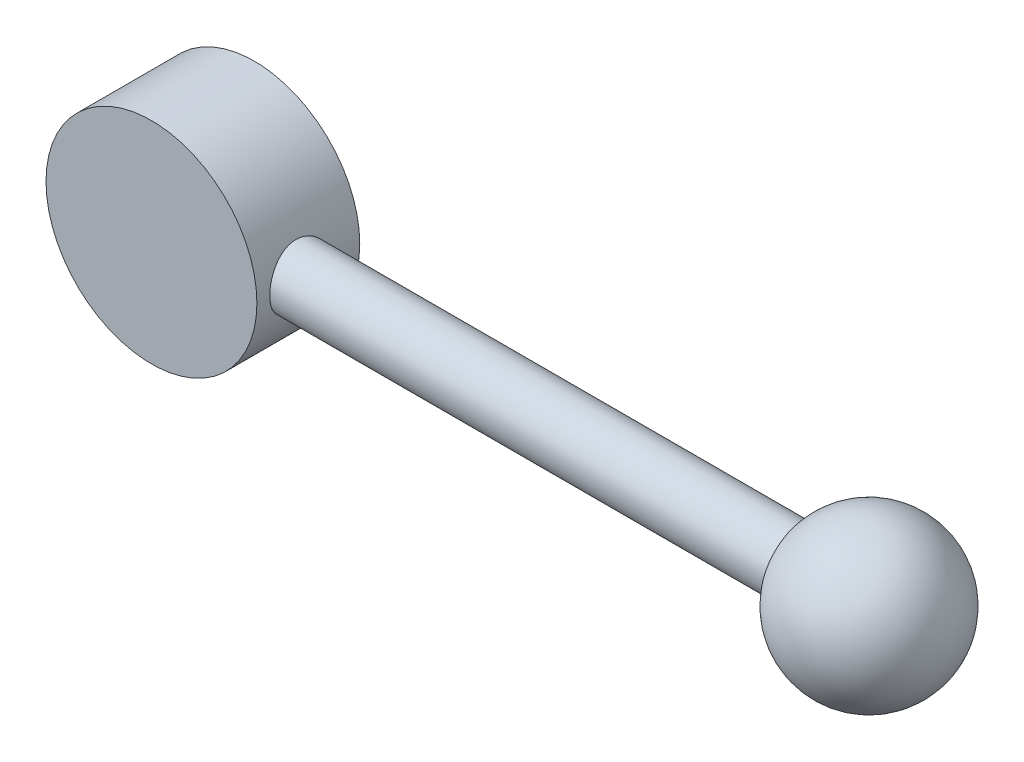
ISO-10303-21;
HEADER;
FILE_DESCRIPTION(('STEP AP214'),'2;1');
FILE_NAME('part.step','',(''),(''),'','','');
FILE_SCHEMA(('AUTOMOTIVE_DESIGN { 1 0 10303 214 1 1 1 1 }'));
ENDSEC;
DATA;
#1=APPLICATION_CONTEXT('core data for automotive mechanical design processes');
#2=APPLICATION_PROTOCOL_DEFINITION('international standard','automotive_design',2000,#1);
#3=PRODUCT_CONTEXT('',#1,'mechanical');
#4=PRODUCT('Part','Part','',(#3));
#5=PRODUCT_RELATED_PRODUCT_CATEGORY('part','',(#4));
#6=PRODUCT_DEFINITION_FORMATION('','',#4);
#7=PRODUCT_DEFINITION_CONTEXT('part definition',#1,'design');
#8=PRODUCT_DEFINITION('design','',#6,#7);
#9=PRODUCT_DEFINITION_SHAPE('','',#8);
#10=(LENGTH_UNIT() NAMED_UNIT(*) SI_UNIT(.MILLI.,.METRE.));
#11=(NAMED_UNIT(*) PLANE_ANGLE_UNIT() SI_UNIT($,.RADIAN.));
#12=(NAMED_UNIT(*) SI_UNIT($,.STERADIAN.) SOLID_ANGLE_UNIT());
#13=UNCERTAINTY_MEASURE_WITH_UNIT(LENGTH_MEASURE(1.E-05),#10,'distance_accuracy_value','');
#14=(GEOMETRIC_REPRESENTATION_CONTEXT(3) GLOBAL_UNCERTAINTY_ASSIGNED_CONTEXT((#13)) GLOBAL_UNIT_ASSIGNED_CONTEXT((#10,
#11,#12)) REPRESENTATION_CONTEXT('',''));
#15=CARTESIAN_POINT('',(0.,0.,0.));
#16=DIRECTION('',(0.,0.,1.));
#17=DIRECTION('',(1.,0.,0.));
#18=AXIS2_PLACEMENT_3D('',#15,#16,#17);
#19=CARTESIAN_POINT('',(0.,0.,0.));
#20=DIRECTION('',(0.,0.,1.));
#21=DIRECTION('',(1.,0.,0.));
#22=AXIS2_PLACEMENT_3D('',#19,#20,#21);
#23=PLANE('',#22);
#24=CARTESIAN_POINT('',(0.,0.,0.));
#25=DIRECTION('',(0.,0.,1.));
#26=DIRECTION('',(1.,0.,0.));
#27=AXIS2_PLACEMENT_3D('',#24,#25,#26);
#28=CIRCLE('',#27,9.5);
#29=CARTESIAN_POINT('',(9.5,0.,0.));
#30=VERTEX_POINT('',#29);
#31=EDGE_CURVE('E8',#30,#30,#28,.T.);
#32=ORIENTED_EDGE('',*,*,#31,.F.);
#33=EDGE_LOOP('',(#32));
#34=FACE_BOUND('',#33,.T.);
#35=CARTESIAN_POINT('',(0.,0.,0.));
#36=DIRECTION('',(0.,0.,-1.));
#37=DIRECTION('',(-1.,0.,0.));
#38=AXIS2_PLACEMENT_3D('',#35,#36,#37);
#39=CIRCLE('',#38,5.);
#40=CARTESIAN_POINT('',(-5.,0.,0.));
#41=VERTEX_POINT('',#40);
#42=EDGE_CURVE('E40',#41,#41,#39,.T.);
#43=ORIENTED_EDGE('',*,*,#42,.F.);
#44=EDGE_LOOP('',(#43));
#45=FACE_BOUND('',#44,.T.);
#46=ADVANCED_FACE('F12',(#34,#45),#23,.F.);
#47=CARTESIAN_POINT('',(0.,0.,40.));
#48=DIRECTION('',(0.,0.,1.));
#49=DIRECTION('',(1.,0.,0.));
#50=AXIS2_PLACEMENT_3D('',#47,#48,#49);
#51=CYLINDRICAL_SURFACE('',#50,9.5);
#52=CARTESIAN_POINT('',(0.,0.,2.));
#53=DIRECTION('',(0.,0.,1.));
#54=DIRECTION('',(1.,0.,0.));
#55=AXIS2_PLACEMENT_3D('',#52,#53,#54);
#56=CIRCLE('',#55,9.5);
#57=CARTESIAN_POINT('',(9.5,0.,2.));
#58=VERTEX_POINT('',#57);
#59=EDGE_CURVE('E34',#58,#58,#56,.T.);
#60=ORIENTED_EDGE('',*,*,#59,.F.);
#61=EDGE_LOOP('',(#60));
#62=FACE_BOUND('',#61,.T.);
#63=ORIENTED_EDGE('',*,*,#31,.T.);
#64=EDGE_LOOP('',(#63));
#65=FACE_BOUND('',#64,.T.);
#66=ADVANCED_FACE('F14',(#62,#65),#51,.T.);
#67=CARTESIAN_POINT('',(20.5,0.,22.));
#68=DIRECTION('',(0.,0.,-1.));
#69=DIRECTION('',(-1.,0.,0.));
#70=AXIS2_PLACEMENT_3D('',#67,#68,#69);
#71=PLANE('',#70);
#72=CARTESIAN_POINT('',(0.,0.,22.));
#73=DIRECTION('',(0.,0.,1.));
#74=DIRECTION('',(1.,0.,0.));
#75=AXIS2_PLACEMENT_3D('',#72,#73,#74);
#76=CIRCLE('',#75,20.5);
#77=CARTESIAN_POINT('',(20.5,0.,22.));
#78=VERTEX_POINT('',#77);
#79=EDGE_CURVE('E25',#78,#78,#76,.T.);
#80=ORIENTED_EDGE('',*,*,#79,.T.);
#81=EDGE_LOOP('',(#80));
#82=FACE_BOUND('',#81,.T.);
#83=ADVANCED_FACE('F70',(#82),#71,.F.);
#84=CARTESIAN_POINT('',(0.,0.,40.));
#85=DIRECTION('',(0.,0.,1.));
#86=DIRECTION('',(1.,0.,0.));
#87=AXIS2_PLACEMENT_3D('',#84,#85,#86);
#88=CYLINDRICAL_SURFACE('',#87,20.5);
#89=CARTESIAN_POINT('',(20.5,0.,7.5));
#90=CARTESIAN_POINT('',(20.4999997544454,-0.164768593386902,7.50000038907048));
#91=CARTESIAN_POINT('',(20.4980087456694,-0.329544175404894,7.50679278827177));
#92=CARTESIAN_POINT('',(20.4900990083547,-0.65788822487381,7.5339021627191));
#93=CARTESIAN_POINT('',(20.4841800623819,-0.821456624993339,7.55421988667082));
#94=CARTESIAN_POINT('',(20.4685766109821,-1.1462122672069,7.60820100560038));
#95=CARTESIAN_POINT('',(20.4588916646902,-1.30739922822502,7.64186596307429));
#96=CARTESIAN_POINT('',(20.4360164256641,-1.62628314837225,7.72226244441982));
#97=CARTESIAN_POINT('',(20.4228249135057,-1.7839788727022,7.76899851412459));
#98=CARTESIAN_POINT('',(20.3933182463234,-2.09448185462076,7.87505403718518));
#99=CARTESIAN_POINT('',(20.3770082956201,-2.24729676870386,7.93435254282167));
#100=CARTESIAN_POINT('',(20.3416823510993,-2.54730770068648,8.06511256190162));
#101=CARTESIAN_POINT('',(20.3226662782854,-2.69450355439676,8.13657443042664));
#102=CARTESIAN_POINT('',(20.2824208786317,-2.98237032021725,8.2911456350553));
#103=CARTESIAN_POINT('',(20.2611910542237,-3.123039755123,8.37425759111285));
#104=CARTESIAN_POINT('',(20.2170775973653,-3.39691169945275,8.55150630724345));
#105=CARTESIAN_POINT('',(20.1941944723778,-3.53011647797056,8.6456396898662));
#106=CARTESIAN_POINT('',(20.146767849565,-3.79154794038,8.84682399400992));
#107=CARTESIAN_POINT('',(20.1221971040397,-3.91956600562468,8.95413966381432));
#108=CARTESIAN_POINT('',(20.0725990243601,-4.1661228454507,9.17897611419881));
#109=CARTESIAN_POINT('',(20.0475718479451,-4.2846648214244,9.29649342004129));
#110=CARTESIAN_POINT('',(19.9977175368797,-4.5116297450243,9.54108035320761));
#111=CARTESIAN_POINT('',(19.9728905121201,-4.62004743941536,9.66815487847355));
#112=CARTESIAN_POINT('',(19.9241410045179,-4.82595045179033,9.93095842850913));
#113=CARTESIAN_POINT('',(19.9002181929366,-4.92343976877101,10.0666842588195));
#114=CARTESIAN_POINT('',(19.8534354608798,-5.10885934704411,10.3490171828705));
#115=CARTESIAN_POINT('',(19.8306098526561,-5.19653638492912,10.4957964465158));
#116=CARTESIAN_POINT('',(19.7872868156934,-5.35913808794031,10.7965125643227));
#117=CARTESIAN_POINT('',(19.766788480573,-5.43406772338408,10.9504465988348));
#118=CARTESIAN_POINT('',(19.7287391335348,-5.57062666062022,11.2645036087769));
#119=CARTESIAN_POINT('',(19.7111887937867,-5.63225293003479,11.4246279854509));
#120=CARTESIAN_POINT('',(19.6796082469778,-5.74162541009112,11.7498143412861));
#121=CARTESIAN_POINT('',(19.6655765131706,-5.78937764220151,11.9148741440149));
#122=CARTESIAN_POINT('',(19.6418018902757,-5.86952471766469,12.2443484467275));
#123=CARTESIAN_POINT('',(19.6319555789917,-5.90229162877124,12.4086649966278));
#124=CARTESIAN_POINT('',(19.6163432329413,-5.95397424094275,12.7395899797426));
#125=CARTESIAN_POINT('',(19.6105755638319,-5.97289549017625,12.9061974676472));
#126=CARTESIAN_POINT('',(19.603301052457,-5.99672775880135,13.2405034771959));
#127=CARTESIAN_POINT('',(19.6017941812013,-6.00163887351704,13.4082019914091));
#128=CARTESIAN_POINT('',(19.6030905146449,-5.99740342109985,13.7434027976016));
#129=CARTESIAN_POINT('',(19.6058936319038,-5.98825713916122,13.9109050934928));
#130=CARTESIAN_POINT('',(19.6155486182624,-5.95655212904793,14.238688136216));
#131=CARTESIAN_POINT('',(19.6222578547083,-5.9344657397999,14.3990190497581));
#132=CARTESIAN_POINT('',(19.6394095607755,-5.87745500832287,14.7172343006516));
#133=CARTESIAN_POINT('',(19.649853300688,-5.84252629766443,14.8751177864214));
#134=CARTESIAN_POINT('',(19.6741615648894,-5.7601395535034,15.187257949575));
#135=CARTESIAN_POINT('',(19.688025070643,-5.71268525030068,15.3415156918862));
#136=CARTESIAN_POINT('',(19.7187796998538,-5.60560692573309,15.6454959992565));
#137=CARTESIAN_POINT('',(19.7356719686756,-5.5459782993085,15.7952168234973));
#138=CARTESIAN_POINT('',(19.7722410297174,-5.41416819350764,16.0910079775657));
#139=CARTESIAN_POINT('',(19.7919506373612,-5.34183608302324,16.2370072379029));
#140=CARTESIAN_POINT('',(19.8334359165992,-5.18568691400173,16.5224423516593));
#141=CARTESIAN_POINT('',(19.8552123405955,-5.10186566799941,16.6618757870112));
#142=CARTESIAN_POINT('',(19.9227548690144,-4.8340177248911,17.0689782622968));
#143=CARTESIAN_POINT('',(19.9707648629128,-4.63350124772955,17.3256854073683));
#144=CARTESIAN_POINT('',(20.0696162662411,-4.18511260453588,17.8126329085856));
#145=CARTESIAN_POINT('',(20.1204944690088,-3.93567819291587,18.0414205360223));
#146=CARTESIAN_POINT('',(20.2176813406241,-3.40132203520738,18.4542852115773));
#147=CARTESIAN_POINT('',(20.2639897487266,-3.11639826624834,18.63835970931));
#148=CARTESIAN_POINT('',(20.3472018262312,-2.51664006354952,18.9573414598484));
#149=CARTESIAN_POINT('',(20.3840462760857,-2.2016334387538,19.0919412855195));
#150=CARTESIAN_POINT('',(20.4437541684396,-1.55212614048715,19.3058343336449));
#151=CARTESIAN_POINT('',(20.4666213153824,-1.21763065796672,19.3851422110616));
#152=CARTESIAN_POINT('',(20.4952175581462,-0.550953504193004,19.4838192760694));
#153=CARTESIAN_POINT('',(20.5015074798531,-0.219085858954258,19.5051506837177));
#154=CARTESIAN_POINT('',(20.4978783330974,0.44350281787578,19.4927506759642));
#155=CARTESIAN_POINT('',(20.4879613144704,0.774223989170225,19.4590262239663));
#156=CARTESIAN_POINT('',(20.4533992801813,1.41781519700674,19.3390673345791));
#157=CARTESIAN_POINT('',(20.4290727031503,1.73091547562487,19.253967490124));
#158=CARTESIAN_POINT('',(20.3684901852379,2.33834273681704,19.0350155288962));
#159=CARTESIAN_POINT('',(20.3322328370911,2.63266749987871,18.901157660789));
#160=CARTESIAN_POINT('',(20.2505580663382,3.201467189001,18.585163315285));
#161=CARTESIAN_POINT('',(20.2049537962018,3.47535043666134,18.4020133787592));
#162=CARTESIAN_POINT('',(20.1098009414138,3.98926947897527,17.9937010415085));
#163=CARTESIAN_POINT('',(20.0602514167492,4.22929716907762,17.7685286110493));
#164=CARTESIAN_POINT('',(19.9860369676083,4.56311282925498,17.3996018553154));
#165=CARTESIAN_POINT('',(19.9608943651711,4.67160496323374,17.2689475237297));
#166=CARTESIAN_POINT('',(19.9116554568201,4.87720494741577,16.9988051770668));
#167=CARTESIAN_POINT('',(19.8875587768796,4.97431688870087,16.8593203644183));
#168=CARTESIAN_POINT('',(19.8411019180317,5.15650338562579,16.5723575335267));
#169=CARTESIAN_POINT('',(19.8187424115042,5.24157329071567,16.4248764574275));
#170=CARTESIAN_POINT('',(19.7764458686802,5.39896546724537,16.1230001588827));
#171=CARTESIAN_POINT('',(19.7565078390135,5.47129297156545,15.9686078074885));
#172=CARTESIAN_POINT('',(19.7197444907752,5.60234699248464,15.6546484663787));
#173=CARTESIAN_POINT('',(19.7029051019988,5.6611353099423,15.49510893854));
#174=CARTESIAN_POINT('',(19.6727610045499,5.76501533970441,15.1713718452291));
#175=CARTESIAN_POINT('',(19.6594548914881,5.81011249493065,15.0071761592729));
#176=CARTESIAN_POINT('',(19.6367999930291,5.88622676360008,14.675294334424));
#177=CARTESIAN_POINT('',(19.6274509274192,5.91724487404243,14.5076084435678));
#178=CARTESIAN_POINT('',(19.6130187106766,5.96490739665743,14.1700260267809));
#179=CARTESIAN_POINT('',(19.6079354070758,5.98155232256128,14.0001295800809));
#180=CARTESIAN_POINT('',(19.6023186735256,5.9999323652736,13.6662567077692));
#181=CARTESIAN_POINT('',(19.6016119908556,6.00223524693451,13.5023141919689));
#182=CARTESIAN_POINT('',(19.6043094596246,5.99341910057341,13.1747666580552));
#183=CARTESIAN_POINT('',(19.6077150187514,5.98229547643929,13.0111617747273));
#184=CARTESIAN_POINT('',(19.6185313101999,5.94672790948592,12.6856110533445));
#185=CARTESIAN_POINT('',(19.6259403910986,5.92228945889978,12.5236645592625));
#186=CARTESIAN_POINT('',(19.6445384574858,5.86030325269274,12.2024601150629));
#187=CARTESIAN_POINT('',(19.6557288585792,5.82275058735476,12.0432031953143));
#188=CARTESIAN_POINT('',(19.6814005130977,5.73537439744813,11.7303823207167));
#189=CARTESIAN_POINT('',(19.6958418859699,5.68569901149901,11.5767736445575));
#190=CARTESIAN_POINT('',(19.7276768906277,5.57423736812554,11.2742707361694));
#191=CARTESIAN_POINT('',(19.7450715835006,5.51244675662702,11.125378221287));
#192=CARTESIAN_POINT('',(19.782319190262,5.37724463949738,10.8333301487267));
#193=CARTESIAN_POINT('',(19.802171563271,5.30383568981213,10.6901733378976));
#194=CARTESIAN_POINT('',(19.8438063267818,5.14587421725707,10.4103722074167));
#195=CARTESIAN_POINT('',(19.8655894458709,5.061317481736,10.2737303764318));
#196=CARTESIAN_POINT('',(19.9112797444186,4.87853600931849,10.0032239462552));
#197=CARTESIAN_POINT('',(19.9352342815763,4.77994030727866,9.86961789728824));
#198=CARTESIAN_POINT('',(19.9839347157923,4.57206196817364,9.61107007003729));
#199=CARTESIAN_POINT('',(20.0086809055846,4.46277534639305,9.48613155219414));
#200=CARTESIAN_POINT('',(20.0582834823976,4.23425660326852,9.24575891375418));
#201=CARTESIAN_POINT('',(20.0831398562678,4.11502564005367,9.13032368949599));
#202=CARTESIAN_POINT('',(20.1323098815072,3.86730499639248,8.90963180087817));
#203=CARTESIAN_POINT('',(20.1566233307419,3.7388119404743,8.80437888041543));
#204=CARTESIAN_POINT('',(20.2046974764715,3.46977987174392,8.6020699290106));
#205=CARTESIAN_POINT('',(20.2284250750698,3.32900807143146,8.50531528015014));
#206=CARTESIAN_POINT('',(20.2739466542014,3.03949915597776,8.32403500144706));
#207=CARTESIAN_POINT('',(20.2957406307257,2.8907620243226,8.23950939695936));
#208=CARTESIAN_POINT('',(20.3367679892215,2.58639447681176,8.0833769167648));
#209=CARTESIAN_POINT('',(20.356002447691,2.43076699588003,8.01176460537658));
#210=CARTESIAN_POINT('',(20.3913677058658,2.11366097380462,7.88201306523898));
#211=CARTESIAN_POINT('',(20.4074988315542,1.95218304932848,7.82387242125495));
#212=CARTESIAN_POINT('',(20.4344672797,1.64423058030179,7.72771145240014));
#213=CARTESIAN_POINT('',(20.4457076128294,1.49828162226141,7.68811373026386));
#214=CARTESIAN_POINT('',(20.4651675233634,1.2036242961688,7.62002138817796));
#215=CARTESIAN_POINT('',(20.4733873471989,1.0549161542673,7.59152586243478));
#216=CARTESIAN_POINT('',(20.4866168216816,0.755624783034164,7.54584620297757));
#217=CARTESIAN_POINT('',(20.491626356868,0.605041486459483,7.52866247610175));
#218=CARTESIAN_POINT('',(20.49831762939,0.302973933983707,7.50574067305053));
#219=CARTESIAN_POINT('',(20.5000002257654,0.151489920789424,7.49999964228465));
#220=CARTESIAN_POINT('',(20.5,0.,7.5));
#221=B_SPLINE_CURVE_WITH_KNOTS('',3,(#89,#90,#91,#92,#93,#94,#95,#96,#97,#98,#99,#100,#101,#102,
#103,#104,#105,#106,#107,#108,#109,#110,#111,#112,#113,#114,#115,#116,#117,#118,#119,#120,#121,
#122,#123,#124,#125,#126,#127,#128,#129,#130,#131,#132,#133,#134,#135,#136,#137,#138,#139,#140,
#141,#142,#143,#144,#145,#146,#147,#148,#149,#150,#151,#152,#153,#154,#155,#156,#157,#158,#159,
#160,#161,#162,#163,#164,#165,#166,#167,#168,#169,#170,#171,#172,#173,#174,#175,#176,#177,#178,
#179,#180,#181,#182,#183,#184,#185,#186,#187,#188,#189,#190,#191,#192,#193,#194,#195,#196,#197,
#198,#199,#200,#201,#202,#203,#204,#205,#206,#207,#208,#209,#210,#211,#212,#213,#214,#215,#216,
#217,#218,#219,#220),.UNSPECIFIED.,.T.,.F.,(4,2,2,2,2,2,2,2,2,2,2,2,2,2,2,2,2,2,2,2,2,2,2,2,2,2,
2,2,2,2,2,2,2,2,2,2,2,2,2,2,2,2,2,2,2,2,2,2,2,2,2,2,2,2,2,2,2,2,2,2,2,2,2,2,2,4),(0.,
0.494166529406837,0.988360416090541,1.48261217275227,1.97703603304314,2.47064184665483,
2.96426207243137,3.45799348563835,3.95157399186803,4.45753270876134,4.96331976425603,
5.46936781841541,5.97523008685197,6.49206535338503,7.00869863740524,7.52544955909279,
8.04197586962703,8.54486934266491,9.04756118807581,9.55024961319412,10.0529278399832,
10.5383093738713,11.0238561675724,11.5092585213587,11.9948448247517,12.4866344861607,
12.9786038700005,13.9617709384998,14.9839152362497,16.006117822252,17.0345689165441,
18.062747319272,19.0556662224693,20.0484595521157,21.0200911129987,21.9918373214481,
22.9853318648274,23.97906383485,24.4935931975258,25.0079370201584,25.5224789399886,
26.0368090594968,26.5487427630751,27.0604726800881,27.5721663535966,28.0838417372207,
28.5751252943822,29.066577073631,29.5578262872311,30.0492596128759,30.5349645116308,
31.0208442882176,31.5066173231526,31.9925744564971,32.4953010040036,32.9982156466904,
33.5010718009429,34.0041121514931,34.5208552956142,35.0375995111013,35.5541256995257,
36.0705976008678,36.525077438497,36.9795201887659,37.4339792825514,37.8883210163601),.UNSPECIFIED.);
#222=CARTESIAN_POINT('',(20.5,0.,7.5));
#223=VERTEX_POINT('',#222);
#224=EDGE_CURVE('E16',#223,#223,#221,.T.);
#225=ORIENTED_EDGE('',*,*,#224,.T.);
#226=EDGE_LOOP('',(#225));
#227=FACE_BOUND('',#226,.T.);
#228=ORIENTED_EDGE('',*,*,#79,.F.);
#229=EDGE_LOOP('',(#228));
#230=FACE_BOUND('',#229,.T.);
#231=CARTESIAN_POINT('',(0.,0.,2.));
#232=DIRECTION('',(0.,0.,1.));
#233=DIRECTION('',(1.,0.,0.));
#234=AXIS2_PLACEMENT_3D('',#231,#232,#233);
#235=CIRCLE('',#234,20.5);
#236=CARTESIAN_POINT('',(20.5,0.,2.));
#237=VERTEX_POINT('',#236);
#238=EDGE_CURVE('E29',#237,#237,#235,.T.);
#239=ORIENTED_EDGE('',*,*,#238,.T.);
#240=EDGE_LOOP('',(#239));
#241=FACE_BOUND('',#240,.T.);
#242=ADVANCED_FACE('F75',(#227,#230,#241),#88,.T.);
#243=CARTESIAN_POINT('',(9.5,0.,2.));
#244=DIRECTION('',(0.,0.,1.));
#245=DIRECTION('',(1.,0.,0.));
#246=AXIS2_PLACEMENT_3D('',#243,#244,#245);
#247=PLANE('',#246);
#248=ORIENTED_EDGE('',*,*,#238,.F.);
#249=EDGE_LOOP('',(#248));
#250=FACE_BOUND('',#249,.T.);
#251=ORIENTED_EDGE('',*,*,#59,.T.);
#252=EDGE_LOOP('',(#251));
#253=FACE_BOUND('',#252,.T.);
#254=ADVANCED_FACE('F80',(#250,#253),#247,.F.);
#255=CARTESIAN_POINT('',(-30.,0.,13.5));
#256=DIRECTION('',(-1.,0.,0.));
#257=DIRECTION('',(0.,0.,1.));
#258=AXIS2_PLACEMENT_3D('',#255,#256,#257);
#259=CYLINDRICAL_SURFACE('',#258,6.);
#260=CARTESIAN_POINT('',(117.252272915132,0.,13.5));
#261=DIRECTION('',(-1.,0.,0.));
#262=DIRECTION('',(0.,0.,1.));
#263=AXIS2_PLACEMENT_3D('',#260,#261,#262);
#264=CIRCLE('',#263,6.);
#265=CARTESIAN_POINT('',(117.252272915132,0.,19.5));
#266=VERTEX_POINT('',#265);
#267=EDGE_CURVE('E37',#266,#266,#264,.T.);
#268=ORIENTED_EDGE('',*,*,#267,.T.);
#269=EDGE_LOOP('',(#268));
#270=FACE_BOUND('',#269,.T.);
#271=ORIENTED_EDGE('',*,*,#224,.F.);
#272=EDGE_LOOP('',(#271));
#273=FACE_BOUND('',#272,.T.);
#274=ADVANCED_FACE('F61',(#270,#273),#259,.T.);
#275=CARTESIAN_POINT('',(131.,0.,13.5));
#276=DIRECTION('',(0.,0.,1.));
#277=DIRECTION('',(1.,0.,0.));
#278=AXIS2_PLACEMENT_3D('',#275,#276,#277);
#279=SPHERICAL_SURFACE('',#278,15.);
#280=CARTESIAN_POINT('',(131.,0.,13.5));
#281=DIRECTION('',(-1.,0.,0.));
#282=DIRECTION('',(0.,0.,1.));
#283=AXIS2_PLACEMENT_3D('',#280,#281,#282);
#284=SPHERICAL_SURFACE('',#283,15.);
#285=ORIENTED_EDGE('',*,*,#267,.F.);
#286=EDGE_LOOP('',(#285));
#287=FACE_BOUND('',#286,.T.);
#288=ADVANCED_FACE('F51',(#287),#284,.T.);
#289=CARTESIAN_POINT('',(0.,0.,0.));
#290=DIRECTION('',(0.,0.,-1.));
#291=DIRECTION('',(-1.,0.,0.));
#292=AXIS2_PLACEMENT_3D('',#289,#290,#291);
#293=CYLINDRICAL_SURFACE('',#292,5.);
#294=ORIENTED_EDGE('',*,*,#42,.T.);
#295=EDGE_LOOP('',(#294));
#296=FACE_BOUND('',#295,.T.);
#297=CARTESIAN_POINT('',(0.,0.,21.));
#298=DIRECTION('',(0.,0.,-1.));
#299=DIRECTION('',(-1.,0.,0.));
#300=AXIS2_PLACEMENT_3D('',#297,#298,#299);
#301=CIRCLE('',#300,5.);
#302=CARTESIAN_POINT('',(-5.,0.,21.));
#303=VERTEX_POINT('',#302);
#304=EDGE_CURVE('E43',#303,#303,#301,.T.);
#305=ORIENTED_EDGE('',*,*,#304,.F.);
#306=EDGE_LOOP('',(#305));
#307=FACE_BOUND('',#306,.T.);
#308=ADVANCED_FACE('F49',(#296,#307),#293,.F.);
#309=CARTESIAN_POINT('',(0.,0.,21.));
#310=DIRECTION('',(0.,0.,-1.));
#311=DIRECTION('',(-1.,0.,0.));
#312=AXIS2_PLACEMENT_3D('',#309,#310,#311);
#313=PLANE('',#312);
#314=ORIENTED_EDGE('',*,*,#304,.T.);
#315=EDGE_LOOP('',(#314));
#316=FACE_BOUND('',#315,.T.);
#317=ADVANCED_FACE('F47',(#316),#313,.T.);
#318=CLOSED_SHELL('',(#46,#66,#83,#242,#254,#274,#288,#308,#317));
#319=MANIFOLD_SOLID_BREP('B1',#318);
#320=ADVANCED_BREP_SHAPE_REPRESENTATION('',(#18,#319),#14);
#321=SHAPE_DEFINITION_REPRESENTATION(#9,#320);
ENDSEC;
END-ISO-10303-21;
